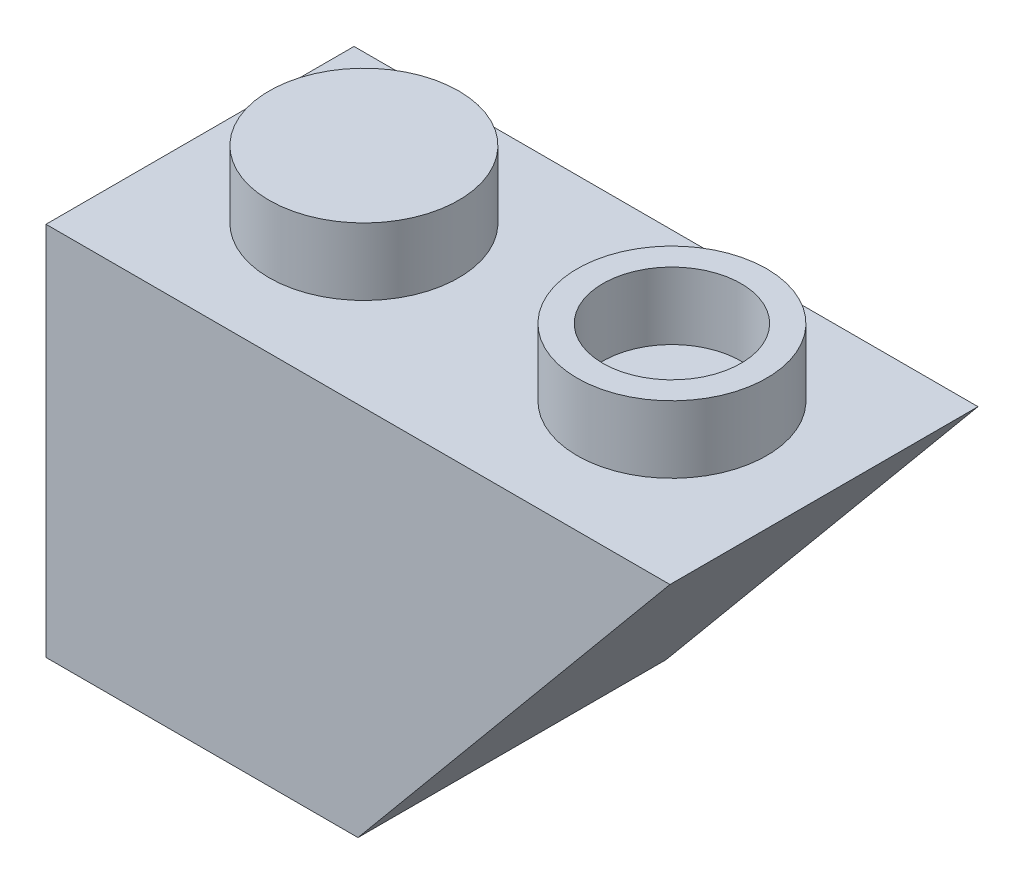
from build123d import *

# Parameters (mm, degrees)
SKETCH1_W           = 15.8
SKETCH1_H           = 7.8
EXTRUDE1_DEPTH      = 9.5
EXTRUDE2_DEPTH      = 15.611639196
EXTRUDE2_DEPTH_BACK = 15.611639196
SKETCH3_W           = 4.8
SKETCH3_H           = 4.8
EXTRUDE3_DEPTH      = 6.6
SKETCH4_R           = 2.4
EXTRUDE4_DEPTH      = 1.7
SKETCH5_R           = 2.4
EXTRUDE5_DEPTH      = 1.7
SKETCH6_R           = 1.75
EXTRUDE7_DEPTH      = 4


with BuildPart() as part:
    # Sketch1 → Extrude1 (new body)
    with BuildSketch(Plane(origin=(0, 0, 0), x_dir=(1, 0, 0), z_dir=(0, 1, 0))):
        Rectangle(SKETCH1_W, SKETCH1_H)
    extrude(amount=EXTRUDE1_DEPTH)

    # Sketch2 → Extrude2 (cut, two sides: drawn at the far end of the back side and taken through both)
    with BuildSketch(Plane(origin=(0, 0, -3.9), x_dir=(-1, 0, 0), z_dir=(0, 0, -1)).offset(-EXTRUDE2_DEPTH_BACK)):
        Polygon((-37.869528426, 45.539306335), (-7.9, 9.5), (0, 0), (29.969528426, -36.039306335), (-42.109084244, -95.978363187), (-109.948141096, -14.399750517), align=None)
    extrude(amount=EXTRUDE2_DEPTH + EXTRUDE2_DEPTH_BACK, mode=Mode.SUBTRACT)

    # Sketch3 → Extrude3 (cut)
    with BuildSketch(Plane.XZ):
        with Locations((-4, 0)):
            Rectangle(SKETCH3_W, SKETCH3_H)
    extrude(amount=-EXTRUDE3_DEPTH, mode=Mode.SUBTRACT)

    # Sketch4 → Extrude4 (add)
    with BuildSketch(Plane(origin=(0, 9.5, 0), x_dir=(1, 0, 0), z_dir=(0, 1, 0))):
        with Locations(Location((-3.9, 0.15, 0), (0, 0, 270))):
            Circle(SKETCH4_R)
    extrude(amount=EXTRUDE4_DEPTH)

    # Sketch5 → Extrude5 (add)
    with BuildSketch(Plane(origin=(0, 9.5, 0), x_dir=(1, 0, 0), z_dir=(0, 1, 0))):
        with Locations(Location((3.9, 0.15, 0), (0, 0, 270))):
            Circle(SKETCH5_R)
    extrude(amount=EXTRUDE5_DEPTH)

    # Sketch6 → Extrude7 (cut)
    with BuildSketch(Plane(origin=(0, 9.5, 0), x_dir=(1, 0, 0), z_dir=(0, 1, 0))):
        with Locations(Location((3.9, 0.15, 0), (0, 0, 270))):
            Circle(SKETCH6_R)
    extrude(amount=EXTRUDE7_DEPTH, mode=Mode.SUBTRACT)


solid = part.part
